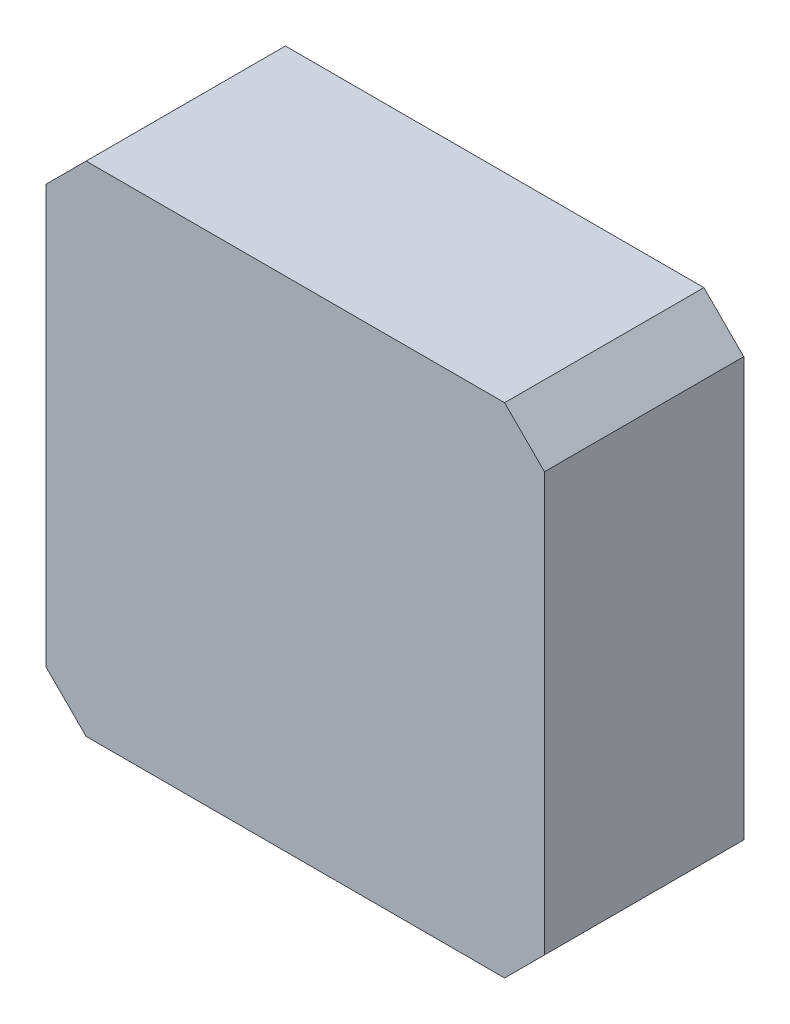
ISO-10303-21;
HEADER;
FILE_DESCRIPTION(('STEP AP214'),'2;1');
FILE_NAME('part.step','',(''),(''),'','','');
FILE_SCHEMA(('AUTOMOTIVE_DESIGN { 1 0 10303 214 1 1 1 1 }'));
ENDSEC;
DATA;
#1=APPLICATION_CONTEXT('core data for automotive mechanical design processes');
#2=APPLICATION_PROTOCOL_DEFINITION('international standard','automotive_design',2000,#1);
#3=PRODUCT_CONTEXT('',#1,'mechanical');
#4=PRODUCT('Part','Part','',(#3));
#5=PRODUCT_RELATED_PRODUCT_CATEGORY('part','',(#4));
#6=PRODUCT_DEFINITION_FORMATION('','',#4);
#7=PRODUCT_DEFINITION_CONTEXT('part definition',#1,'design');
#8=PRODUCT_DEFINITION('design','',#6,#7);
#9=PRODUCT_DEFINITION_SHAPE('','',#8);
#10=(LENGTH_UNIT() NAMED_UNIT(*) SI_UNIT(.MILLI.,.METRE.));
#11=(NAMED_UNIT(*) PLANE_ANGLE_UNIT() SI_UNIT($,.RADIAN.));
#12=(NAMED_UNIT(*) SI_UNIT($,.STERADIAN.) SOLID_ANGLE_UNIT());
#13=UNCERTAINTY_MEASURE_WITH_UNIT(LENGTH_MEASURE(1.E-05),#10,'distance_accuracy_value','');
#14=(GEOMETRIC_REPRESENTATION_CONTEXT(3) GLOBAL_UNCERTAINTY_ASSIGNED_CONTEXT((#13)) GLOBAL_UNIT_ASSIGNED_CONTEXT((#10,
#11,#12)) REPRESENTATION_CONTEXT('',''));
#15=CARTESIAN_POINT('',(0.,0.,0.));
#16=DIRECTION('',(0.,0.,1.));
#17=DIRECTION('',(1.,0.,0.));
#18=AXIS2_PLACEMENT_3D('',#15,#16,#17);
#19=CARTESIAN_POINT('',(0.,0.,10.));
#20=DIRECTION('',(1.,0.,0.));
#21=DIRECTION('',(0.,1.,0.));
#22=AXIS2_PLACEMENT_3D('',#19,#20,#21);
#23=PLANE('',#22);
#24=DIRECTION('',(0.,-1.,0.));
#25=VECTOR('',#24,1.);
#26=CARTESIAN_POINT('',(0.,0.,0.));
#27=LINE('',#26,#25);
#28=CARTESIAN_POINT('',(0.,23.,0.));
#29=VERTEX_POINT('',#28);
#30=CARTESIAN_POINT('',(0.,2.,0.));
#31=VERTEX_POINT('',#30);
#32=EDGE_CURVE('E124',#29,#31,#27,.T.);
#33=ORIENTED_EDGE('',*,*,#32,.T.);
#34=DIRECTION('',(0.,0.,1.));
#35=VECTOR('',#34,1.);
#36=CARTESIAN_POINT('',(0.,2.,10.));
#37=LINE('',#36,#35);
#38=CARTESIAN_POINT('',(0.,2.00000000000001,10.));
#39=VERTEX_POINT('',#38);
#40=EDGE_CURVE('E154',#31,#39,#37,.T.);
#41=ORIENTED_EDGE('',*,*,#40,.T.);
#42=DIRECTION('',(0.,-1.,0.));
#43=VECTOR('',#42,1.);
#44=CARTESIAN_POINT('',(0.,0.,10.));
#45=LINE('',#44,#43);
#46=CARTESIAN_POINT('',(0.,23.,10.));
#47=VERTEX_POINT('',#46);
#48=EDGE_CURVE('E122',#47,#39,#45,.T.);
#49=ORIENTED_EDGE('',*,*,#48,.F.);
#50=DIRECTION('',(0.,0.,-1.));
#51=VECTOR('',#50,1.);
#52=CARTESIAN_POINT('',(0.,23.,10.));
#53=LINE('',#52,#51);
#54=EDGE_CURVE('E151',#47,#29,#53,.T.);
#55=ORIENTED_EDGE('',*,*,#54,.T.);
#56=EDGE_LOOP('',(#33,#41,#49,#55));
#57=FACE_BOUND('',#56,.T.);
#58=ADVANCED_FACE('F30',(#57),#23,.F.);
#59=CARTESIAN_POINT('',(0.,0.,10.));
#60=DIRECTION('',(0.,1.,0.));
#61=DIRECTION('',(0.,0.,1.));
#62=AXIS2_PLACEMENT_3D('',#59,#60,#61);
#63=PLANE('',#62);
#64=DIRECTION('',(1.,0.,0.));
#65=VECTOR('',#64,1.);
#66=CARTESIAN_POINT('',(0.,0.,0.));
#67=LINE('',#66,#65);
#68=CARTESIAN_POINT('',(2.,0.,0.));
#69=VERTEX_POINT('',#68);
#70=CARTESIAN_POINT('',(23.,0.,0.));
#71=VERTEX_POINT('',#70);
#72=EDGE_CURVE('E120',#69,#71,#67,.T.);
#73=ORIENTED_EDGE('',*,*,#72,.T.);
#74=DIRECTION('',(0.,0.,1.));
#75=VECTOR('',#74,1.);
#76=CARTESIAN_POINT('',(23.,0.,10.));
#77=LINE('',#76,#75);
#78=CARTESIAN_POINT('',(23.,0.,10.));
#79=VERTEX_POINT('',#78);
#80=EDGE_CURVE('E99',#71,#79,#77,.T.);
#81=ORIENTED_EDGE('',*,*,#80,.T.);
#82=DIRECTION('',(1.,0.,0.));
#83=VECTOR('',#82,1.);
#84=CARTESIAN_POINT('',(0.,0.,10.));
#85=LINE('',#84,#83);
#86=CARTESIAN_POINT('',(2.,0.,10.));
#87=VERTEX_POINT('',#86);
#88=EDGE_CURVE('E130',#87,#79,#85,.T.);
#89=ORIENTED_EDGE('',*,*,#88,.F.);
#90=DIRECTION('',(0.,0.,-1.));
#91=VECTOR('',#90,1.);
#92=CARTESIAN_POINT('',(2.,0.,10.));
#93=LINE('',#92,#91);
#94=EDGE_CURVE('E104',#87,#69,#93,.T.);
#95=ORIENTED_EDGE('',*,*,#94,.T.);
#96=EDGE_LOOP('',(#73,#81,#89,#95));
#97=FACE_BOUND('',#96,.T.);
#98=ADVANCED_FACE('F175',(#97),#63,.F.);
#99=CARTESIAN_POINT('',(25.,0.,10.));
#100=DIRECTION('',(-1.,0.,0.));
#101=DIRECTION('',(0.,-1.,0.));
#102=AXIS2_PLACEMENT_3D('',#99,#100,#101);
#103=PLANE('',#102);
#104=DIRECTION('',(0.,1.,0.));
#105=VECTOR('',#104,1.);
#106=CARTESIAN_POINT('',(25.,0.,10.));
#107=LINE('',#106,#105);
#108=CARTESIAN_POINT('',(25.,2.,10.));
#109=VERTEX_POINT('',#108);
#110=CARTESIAN_POINT('',(25.,23.,10.));
#111=VERTEX_POINT('',#110);
#112=EDGE_CURVE('E113',#109,#111,#107,.T.);
#113=ORIENTED_EDGE('',*,*,#112,.F.);
#114=DIRECTION('',(0.,0.,-1.));
#115=VECTOR('',#114,1.);
#116=CARTESIAN_POINT('',(25.,2.,10.));
#117=LINE('',#116,#115);
#118=CARTESIAN_POINT('',(25.,2.,0.));
#119=VERTEX_POINT('',#118);
#120=EDGE_CURVE('E98',#109,#119,#117,.T.);
#121=ORIENTED_EDGE('',*,*,#120,.T.);
#122=DIRECTION('',(0.,1.,0.));
#123=VECTOR('',#122,1.);
#124=CARTESIAN_POINT('',(25.,0.,0.));
#125=LINE('',#124,#123);
#126=CARTESIAN_POINT('',(25.,23.,0.));
#127=VERTEX_POINT('',#126);
#128=EDGE_CURVE('E111',#119,#127,#125,.T.);
#129=ORIENTED_EDGE('',*,*,#128,.T.);
#130=DIRECTION('',(0.,0.,1.));
#131=VECTOR('',#130,1.);
#132=CARTESIAN_POINT('',(25.,23.,10.));
#133=LINE('',#132,#131);
#134=EDGE_CURVE('E115',#127,#111,#133,.T.);
#135=ORIENTED_EDGE('',*,*,#134,.T.);
#136=EDGE_LOOP('',(#113,#121,#129,#135));
#137=FACE_BOUND('',#136,.T.);
#138=ADVANCED_FACE('F110',(#137),#103,.F.);
#139=CARTESIAN_POINT('',(0.,25.,10.));
#140=DIRECTION('',(0.,-1.,0.));
#141=DIRECTION('',(0.,0.,-1.));
#142=AXIS2_PLACEMENT_3D('',#139,#140,#141);
#143=PLANE('',#142);
#144=DIRECTION('',(-1.,0.,0.));
#145=VECTOR('',#144,1.);
#146=CARTESIAN_POINT('',(0.,25.,0.));
#147=LINE('',#146,#145);
#148=CARTESIAN_POINT('',(23.,25.,0.));
#149=VERTEX_POINT('',#148);
#150=CARTESIAN_POINT('',(2.00000000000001,25.,0.));
#151=VERTEX_POINT('',#150);
#152=EDGE_CURVE('E119',#149,#151,#147,.T.);
#153=ORIENTED_EDGE('',*,*,#152,.T.);
#154=DIRECTION('',(0.,0.,1.));
#155=VECTOR('',#154,1.);
#156=CARTESIAN_POINT('',(2.00000000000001,25.,10.));
#157=LINE('',#156,#155);
#158=CARTESIAN_POINT('',(2.00000000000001,25.,10.));
#159=VERTEX_POINT('',#158);
#160=EDGE_CURVE('E11',#151,#159,#157,.T.);
#161=ORIENTED_EDGE('',*,*,#160,.T.);
#162=DIRECTION('',(-1.,0.,0.));
#163=VECTOR('',#162,1.);
#164=CARTESIAN_POINT('',(0.,25.,10.));
#165=LINE('',#164,#163);
#166=CARTESIAN_POINT('',(23.,25.,10.));
#167=VERTEX_POINT('',#166);
#168=EDGE_CURVE('E134',#167,#159,#165,.T.);
#169=ORIENTED_EDGE('',*,*,#168,.F.);
#170=DIRECTION('',(0.,0.,-1.));
#171=VECTOR('',#170,1.);
#172=CARTESIAN_POINT('',(23.,25.,10.));
#173=LINE('',#172,#171);
#174=EDGE_CURVE('E37',#167,#149,#173,.T.);
#175=ORIENTED_EDGE('',*,*,#174,.T.);
#176=EDGE_LOOP('',(#153,#161,#169,#175));
#177=FACE_BOUND('',#176,.T.);
#178=ADVANCED_FACE('F157',(#177),#143,.F.);
#179=CARTESIAN_POINT('',(0.,25.,10.));
#180=DIRECTION('',(0.,0.,-1.));
#181=DIRECTION('',(-1.,0.,0.));
#182=AXIS2_PLACEMENT_3D('',#179,#180,#181);
#183=PLANE('',#182);
#184=ORIENTED_EDGE('',*,*,#88,.T.);
#185=DIRECTION('',(-0.707106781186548,-0.707106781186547,0.));
#186=VECTOR('',#185,1.);
#187=CARTESIAN_POINT('',(25.,2.,10.));
#188=LINE('',#187,#186);
#189=EDGE_CURVE('E149',#79,#109,#188,.F.);
#190=ORIENTED_EDGE('',*,*,#189,.T.);
#191=ORIENTED_EDGE('',*,*,#112,.T.);
#192=DIRECTION('',(0.707106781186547,-0.707106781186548,0.));
#193=VECTOR('',#192,1.);
#194=CARTESIAN_POINT('',(23.,25.,10.));
#195=LINE('',#194,#193);
#196=EDGE_CURVE('E49',#111,#167,#195,.F.);
#197=ORIENTED_EDGE('',*,*,#196,.T.);
#198=ORIENTED_EDGE('',*,*,#168,.T.);
#199=DIRECTION('',(0.707106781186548,0.707106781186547,0.));
#200=VECTOR('',#199,1.);
#201=CARTESIAN_POINT('',(0.,23.,10.));
#202=LINE('',#201,#200);
#203=EDGE_CURVE('E145',#159,#47,#202,.F.);
#204=ORIENTED_EDGE('',*,*,#203,.T.);
#205=ORIENTED_EDGE('',*,*,#48,.T.);
#206=DIRECTION('',(-0.707106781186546,0.707106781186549,0.));
#207=VECTOR('',#206,1.);
#208=CARTESIAN_POINT('',(2.,0.,10.));
#209=LINE('',#208,#207);
#210=EDGE_CURVE('E147',#39,#87,#209,.F.);
#211=ORIENTED_EDGE('',*,*,#210,.T.);
#212=EDGE_LOOP('',(#184,#190,#191,#197,#198,#204,#205,#211));
#213=FACE_BOUND('',#212,.T.);
#214=ADVANCED_FACE('F169',(#213),#183,.F.);
#215=CARTESIAN_POINT('',(0.,25.,0.));
#216=DIRECTION('',(0.,0.,-1.));
#217=DIRECTION('',(-1.,0.,0.));
#218=AXIS2_PLACEMENT_3D('',#215,#216,#217);
#219=PLANE('',#218);
#220=ORIENTED_EDGE('',*,*,#128,.F.);
#221=DIRECTION('',(0.707106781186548,0.707106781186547,0.));
#222=VECTOR('',#221,1.);
#223=CARTESIAN_POINT('',(24.,0.999999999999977,0.));
#224=LINE('',#223,#222);
#225=EDGE_CURVE('E94',#119,#71,#224,.F.);
#226=ORIENTED_EDGE('',*,*,#225,.T.);
#227=ORIENTED_EDGE('',*,*,#72,.F.);
#228=DIRECTION('',(0.707106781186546,-0.707106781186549,0.));
#229=VECTOR('',#228,1.);
#230=CARTESIAN_POINT('',(-11.5,13.5,0.));
#231=LINE('',#230,#229);
#232=EDGE_CURVE('E105',#69,#31,#231,.F.);
#233=ORIENTED_EDGE('',*,*,#232,.T.);
#234=ORIENTED_EDGE('',*,*,#32,.F.);
#235=DIRECTION('',(-0.707106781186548,-0.707106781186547,0.));
#236=VECTOR('',#235,1.);
#237=CARTESIAN_POINT('',(0.999999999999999,24.,0.));
#238=LINE('',#237,#236);
#239=EDGE_CURVE('E138',#29,#151,#238,.F.);
#240=ORIENTED_EDGE('',*,*,#239,.T.);
#241=ORIENTED_EDGE('',*,*,#152,.F.);
#242=DIRECTION('',(-0.707106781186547,0.707106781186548,0.));
#243=VECTOR('',#242,1.);
#244=CARTESIAN_POINT('',(11.5,36.5,0.));
#245=LINE('',#244,#243);
#246=EDGE_CURVE('E114',#149,#127,#245,.F.);
#247=ORIENTED_EDGE('',*,*,#246,.T.);
#248=EDGE_LOOP('',(#220,#226,#227,#233,#234,#240,#241,#247));
#249=FACE_BOUND('',#248,.T.);
#250=ADVANCED_FACE('F117',(#249),#219,.T.);
#251=CARTESIAN_POINT('',(25.,2.,10.));
#252=DIRECTION('',(-0.707106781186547,0.707106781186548,0.));
#253=DIRECTION('',(-0.707106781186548,-0.707106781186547,0.));
#254=AXIS2_PLACEMENT_3D('',#251,#252,#253);
#255=PLANE('',#254);
#256=ORIENTED_EDGE('',*,*,#189,.F.);
#257=ORIENTED_EDGE('',*,*,#80,.F.);
#258=ORIENTED_EDGE('',*,*,#225,.F.);
#259=ORIENTED_EDGE('',*,*,#120,.F.);
#260=EDGE_LOOP('',(#256,#257,#258,#259));
#261=FACE_BOUND('',#260,.T.);
#262=ADVANCED_FACE('F97',(#261),#255,.F.);
#263=CARTESIAN_POINT('',(2.,0.,10.));
#264=DIRECTION('',(0.707106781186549,0.707106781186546,0.));
#265=DIRECTION('',(-0.707106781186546,0.707106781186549,0.));
#266=AXIS2_PLACEMENT_3D('',#263,#264,#265);
#267=PLANE('',#266);
#268=ORIENTED_EDGE('',*,*,#210,.F.);
#269=ORIENTED_EDGE('',*,*,#40,.F.);
#270=ORIENTED_EDGE('',*,*,#232,.F.);
#271=ORIENTED_EDGE('',*,*,#94,.F.);
#272=EDGE_LOOP('',(#268,#269,#270,#271));
#273=FACE_BOUND('',#272,.T.);
#274=ADVANCED_FACE('F173',(#273),#267,.F.);
#275=CARTESIAN_POINT('',(0.,23.,10.));
#276=DIRECTION('',(0.707106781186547,-0.707106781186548,0.));
#277=DIRECTION('',(0.707106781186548,0.707106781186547,0.));
#278=AXIS2_PLACEMENT_3D('',#275,#276,#277);
#279=PLANE('',#278);
#280=ORIENTED_EDGE('',*,*,#203,.F.);
#281=ORIENTED_EDGE('',*,*,#160,.F.);
#282=ORIENTED_EDGE('',*,*,#239,.F.);
#283=ORIENTED_EDGE('',*,*,#54,.F.);
#284=EDGE_LOOP('',(#280,#281,#282,#283));
#285=FACE_BOUND('',#284,.T.);
#286=ADVANCED_FACE('F164',(#285),#279,.F.);
#287=CARTESIAN_POINT('',(23.,25.,10.));
#288=DIRECTION('',(-0.707106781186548,-0.707106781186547,0.));
#289=DIRECTION('',(0.707106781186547,-0.707106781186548,0.));
#290=AXIS2_PLACEMENT_3D('',#287,#288,#289);
#291=PLANE('',#290);
#292=ORIENTED_EDGE('',*,*,#196,.F.);
#293=ORIENTED_EDGE('',*,*,#134,.F.);
#294=ORIENTED_EDGE('',*,*,#246,.F.);
#295=ORIENTED_EDGE('',*,*,#174,.F.);
#296=EDGE_LOOP('',(#292,#293,#294,#295));
#297=FACE_BOUND('',#296,.T.);
#298=ADVANCED_FACE('F176',(#297),#291,.F.);
#299=CLOSED_SHELL('',(#58,#98,#138,#178,#214,#250,#262,#274,#286,#298));
#300=MANIFOLD_SOLID_BREP('B2',#299);
#301=ADVANCED_BREP_SHAPE_REPRESENTATION('',(#18,#300),#14);
#302=SHAPE_DEFINITION_REPRESENTATION(#9,#301);
ENDSEC;
END-ISO-10303-21;
